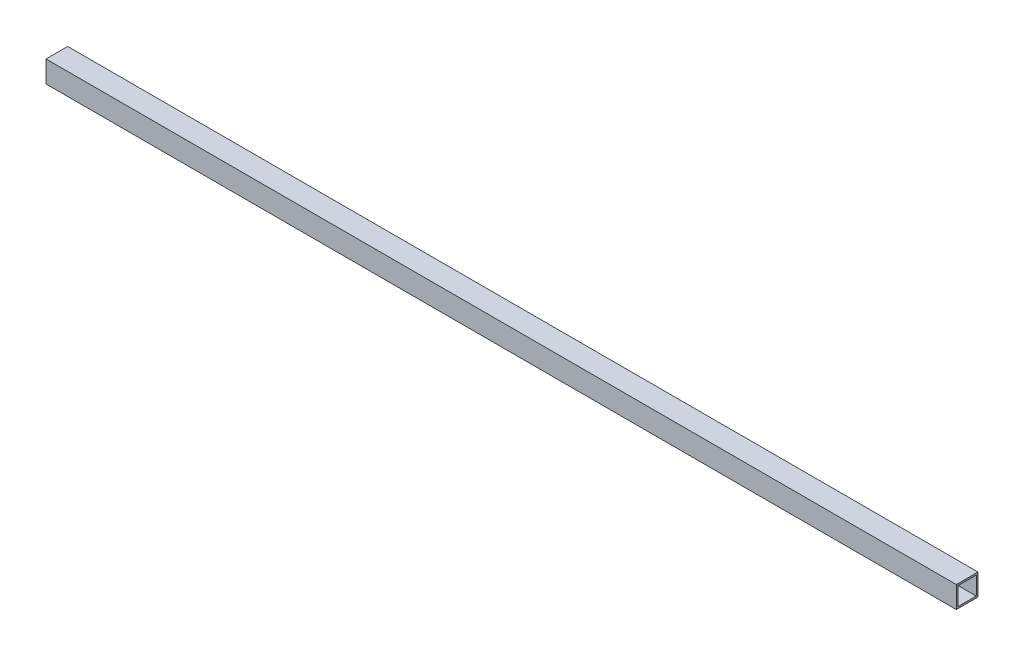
ISO-10303-21;
HEADER;
FILE_DESCRIPTION(('STEP AP214'),'2;1');
FILE_NAME('part.step','',(''),(''),'','','');
FILE_SCHEMA(('AUTOMOTIVE_DESIGN { 1 0 10303 214 1 1 1 1 }'));
ENDSEC;
DATA;
#1=APPLICATION_CONTEXT('core data for automotive mechanical design processes');
#2=APPLICATION_PROTOCOL_DEFINITION('international standard','automotive_design',2000,#1);
#3=PRODUCT_CONTEXT('',#1,'mechanical');
#4=PRODUCT('Part','Part','',(#3));
#5=PRODUCT_RELATED_PRODUCT_CATEGORY('part','',(#4));
#6=PRODUCT_DEFINITION_FORMATION('','',#4);
#7=PRODUCT_DEFINITION_CONTEXT('part definition',#1,'design');
#8=PRODUCT_DEFINITION('design','',#6,#7);
#9=PRODUCT_DEFINITION_SHAPE('','',#8);
#10=(LENGTH_UNIT() NAMED_UNIT(*) SI_UNIT(.MILLI.,.METRE.));
#11=(NAMED_UNIT(*) PLANE_ANGLE_UNIT() SI_UNIT($,.RADIAN.));
#12=(NAMED_UNIT(*) SI_UNIT($,.STERADIAN.) SOLID_ANGLE_UNIT());
#13=UNCERTAINTY_MEASURE_WITH_UNIT(LENGTH_MEASURE(1.E-05),#10,'distance_accuracy_value','');
#14=(GEOMETRIC_REPRESENTATION_CONTEXT(3) GLOBAL_UNCERTAINTY_ASSIGNED_CONTEXT((#13)) GLOBAL_UNIT_ASSIGNED_CONTEXT((#10,
#11,#12)) REPRESENTATION_CONTEXT('',''));
#15=CARTESIAN_POINT('',(0.,0.,0.));
#16=DIRECTION('',(0.,0.,1.));
#17=DIRECTION('',(1.,0.,0.));
#18=AXIS2_PLACEMENT_3D('',#15,#16,#17);
#19=CARTESIAN_POINT('',(1050.,0.,25.));
#20=DIRECTION('',(0.,1.,0.));
#21=DIRECTION('',(-1.,0.,0.));
#22=AXIS2_PLACEMENT_3D('',#19,#20,#21);
#23=PLANE('',#22);
#24=DIRECTION('',(1.,0.,0.));
#25=VECTOR('',#24,1.);
#26=CARTESIAN_POINT('',(1050.,0.,0.));
#27=LINE('',#26,#25);
#28=CARTESIAN_POINT('',(0.,0.,0.));
#29=VERTEX_POINT('',#28);
#30=CARTESIAN_POINT('',(1050.,0.,0.));
#31=VERTEX_POINT('',#30);
#32=EDGE_CURVE('E142',#29,#31,#27,.T.);
#33=ORIENTED_EDGE('',*,*,#32,.T.);
#34=DIRECTION('',(0.,0.,-1.));
#35=VECTOR('',#34,1.);
#36=CARTESIAN_POINT('',(1050.,0.,25.));
#37=LINE('',#36,#35);
#38=CARTESIAN_POINT('',(1050.,0.,25.));
#39=VERTEX_POINT('',#38);
#40=EDGE_CURVE('E12',#39,#31,#37,.T.);
#41=ORIENTED_EDGE('',*,*,#40,.F.);
#42=DIRECTION('',(1.,0.,0.));
#43=VECTOR('',#42,1.);
#44=CARTESIAN_POINT('',(1050.,0.,25.));
#45=LINE('',#44,#43);
#46=CARTESIAN_POINT('',(0.,0.,25.));
#47=VERTEX_POINT('',#46);
#48=EDGE_CURVE('E146',#47,#39,#45,.T.);
#49=ORIENTED_EDGE('',*,*,#48,.F.);
#50=DIRECTION('',(0.,0.,-1.));
#51=VECTOR('',#50,1.);
#52=CARTESIAN_POINT('',(0.,0.,25.));
#53=LINE('',#52,#51);
#54=EDGE_CURVE('E156',#47,#29,#53,.T.);
#55=ORIENTED_EDGE('',*,*,#54,.T.);
#56=EDGE_LOOP('',(#33,#41,#49,#55));
#57=FACE_BOUND('',#56,.T.);
#58=ADVANCED_FACE('F45',(#57),#23,.F.);
#59=CARTESIAN_POINT('',(1050.,25.,25.));
#60=DIRECTION('',(-1.,0.,0.));
#61=DIRECTION('',(0.,0.,1.));
#62=AXIS2_PLACEMENT_3D('',#59,#60,#61);
#63=PLANE('',#62);
#64=DIRECTION('',(0.,0.,-1.));
#65=VECTOR('',#64,1.);
#66=CARTESIAN_POINT('',(1050.,23.0000000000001,2.));
#67=LINE('',#66,#65);
#68=CARTESIAN_POINT('',(1050.,23.0000000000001,23.));
#69=VERTEX_POINT('',#68);
#70=CARTESIAN_POINT('',(1050.,23.0000000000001,2.));
#71=VERTEX_POINT('',#70);
#72=EDGE_CURVE('E117',#69,#71,#67,.T.);
#73=ORIENTED_EDGE('',*,*,#72,.T.);
#74=DIRECTION('',(0.,-1.,0.));
#75=VECTOR('',#74,1.);
#76=CARTESIAN_POINT('',(1050.,2.00000000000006,2.));
#77=LINE('',#76,#75);
#78=CARTESIAN_POINT('',(1050.,2.00000000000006,2.));
#79=VERTEX_POINT('',#78);
#80=EDGE_CURVE('E111',#71,#79,#77,.T.);
#81=ORIENTED_EDGE('',*,*,#80,.T.);
#82=DIRECTION('',(0.,0.,1.));
#83=VECTOR('',#82,1.);
#84=CARTESIAN_POINT('',(1050.,2.00000000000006,2.));
#85=LINE('',#84,#83);
#86=CARTESIAN_POINT('',(1050.,2.00000000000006,23.));
#87=VERTEX_POINT('',#86);
#88=EDGE_CURVE('E120',#79,#87,#85,.T.);
#89=ORIENTED_EDGE('',*,*,#88,.T.);
#90=DIRECTION('',(0.,1.,0.));
#91=VECTOR('',#90,1.);
#92=CARTESIAN_POINT('',(1050.,2.00000000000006,23.));
#93=LINE('',#92,#91);
#94=EDGE_CURVE('E59',#87,#69,#93,.T.);
#95=ORIENTED_EDGE('',*,*,#94,.T.);
#96=EDGE_LOOP('',(#73,#81,#89,#95));
#97=FACE_BOUND('',#96,.T.);
#98=DIRECTION('',(0.,1.,0.));
#99=VECTOR('',#98,1.);
#100=CARTESIAN_POINT('',(1050.,25.,0.));
#101=LINE('',#100,#99);
#102=CARTESIAN_POINT('',(1050.,25.,0.));
#103=VERTEX_POINT('',#102);
#104=EDGE_CURVE('E159',#31,#103,#101,.T.);
#105=ORIENTED_EDGE('',*,*,#104,.T.);
#106=DIRECTION('',(0.,0.,-1.));
#107=VECTOR('',#106,1.);
#108=CARTESIAN_POINT('',(1050.,25.,25.));
#109=LINE('',#108,#107);
#110=CARTESIAN_POINT('',(1050.,25.,25.));
#111=VERTEX_POINT('',#110);
#112=EDGE_CURVE('E52',#111,#103,#109,.T.);
#113=ORIENTED_EDGE('',*,*,#112,.F.);
#114=DIRECTION('',(0.,1.,0.));
#115=VECTOR('',#114,1.);
#116=CARTESIAN_POINT('',(1050.,25.,25.));
#117=LINE('',#116,#115);
#118=EDGE_CURVE('E149',#39,#111,#117,.T.);
#119=ORIENTED_EDGE('',*,*,#118,.F.);
#120=ORIENTED_EDGE('',*,*,#40,.T.);
#121=EDGE_LOOP('',(#105,#113,#119,#120));
#122=FACE_BOUND('',#121,.T.);
#123=ADVANCED_FACE('F124',(#97,#122),#63,.F.);
#124=CARTESIAN_POINT('',(0.,25.,25.));
#125=DIRECTION('',(0.,-1.,0.));
#126=DIRECTION('',(1.,0.,0.));
#127=AXIS2_PLACEMENT_3D('',#124,#125,#126);
#128=PLANE('',#127);
#129=DIRECTION('',(-1.,0.,0.));
#130=VECTOR('',#129,1.);
#131=CARTESIAN_POINT('',(0.,25.,0.));
#132=LINE('',#131,#130);
#133=CARTESIAN_POINT('',(0.,25.,0.));
#134=VERTEX_POINT('',#133);
#135=EDGE_CURVE('E161',#103,#134,#132,.T.);
#136=ORIENTED_EDGE('',*,*,#135,.T.);
#137=DIRECTION('',(0.,0.,-1.));
#138=VECTOR('',#137,1.);
#139=CARTESIAN_POINT('',(0.,25.,25.));
#140=LINE('',#139,#138);
#141=CARTESIAN_POINT('',(0.,25.,25.));
#142=VERTEX_POINT('',#141);
#143=EDGE_CURVE('E167',#142,#134,#140,.T.);
#144=ORIENTED_EDGE('',*,*,#143,.F.);
#145=DIRECTION('',(-1.,0.,0.));
#146=VECTOR('',#145,1.);
#147=CARTESIAN_POINT('',(0.,25.,25.));
#148=LINE('',#147,#146);
#149=EDGE_CURVE('E152',#111,#142,#148,.T.);
#150=ORIENTED_EDGE('',*,*,#149,.F.);
#151=ORIENTED_EDGE('',*,*,#112,.T.);
#152=EDGE_LOOP('',(#136,#144,#150,#151));
#153=FACE_BOUND('',#152,.T.);
#154=ADVANCED_FACE('F174',(#153),#128,.F.);
#155=CARTESIAN_POINT('',(0.,0.,25.));
#156=DIRECTION('',(1.,0.,0.));
#157=DIRECTION('',(0.,0.,-1.));
#158=AXIS2_PLACEMENT_3D('',#155,#156,#157);
#159=PLANE('',#158);
#160=DIRECTION('',(0.,0.,1.));
#161=VECTOR('',#160,1.);
#162=CARTESIAN_POINT('',(0.,2.,2.));
#163=LINE('',#162,#161);
#164=CARTESIAN_POINT('',(0.,2.,2.));
#165=VERTEX_POINT('',#164);
#166=CARTESIAN_POINT('',(0.,2.,23.));
#167=VERTEX_POINT('',#166);
#168=EDGE_CURVE('E136',#165,#167,#163,.T.);
#169=ORIENTED_EDGE('',*,*,#168,.F.);
#170=DIRECTION('',(0.,-1.,0.));
#171=VECTOR('',#170,1.);
#172=CARTESIAN_POINT('',(0.,2.,2.));
#173=LINE('',#172,#171);
#174=CARTESIAN_POINT('',(0.,23.,2.));
#175=VERTEX_POINT('',#174);
#176=EDGE_CURVE('E67',#175,#165,#173,.T.);
#177=ORIENTED_EDGE('',*,*,#176,.F.);
#178=DIRECTION('',(0.,0.,-1.));
#179=VECTOR('',#178,1.);
#180=CARTESIAN_POINT('',(0.,23.,2.));
#181=LINE('',#180,#179);
#182=CARTESIAN_POINT('',(0.,23.,23.));
#183=VERTEX_POINT('',#182);
#184=EDGE_CURVE('E127',#183,#175,#181,.T.);
#185=ORIENTED_EDGE('',*,*,#184,.F.);
#186=DIRECTION('',(0.,1.,0.));
#187=VECTOR('',#186,1.);
#188=CARTESIAN_POINT('',(0.,2.,23.));
#189=LINE('',#188,#187);
#190=EDGE_CURVE('E130',#167,#183,#189,.T.);
#191=ORIENTED_EDGE('',*,*,#190,.F.);
#192=EDGE_LOOP('',(#169,#177,#185,#191));
#193=FACE_BOUND('',#192,.T.);
#194=DIRECTION('',(0.,-1.,0.));
#195=VECTOR('',#194,1.);
#196=CARTESIAN_POINT('',(0.,0.,0.));
#197=LINE('',#196,#195);
#198=EDGE_CURVE('E150',#134,#29,#197,.T.);
#199=ORIENTED_EDGE('',*,*,#198,.T.);
#200=ORIENTED_EDGE('',*,*,#54,.F.);
#201=DIRECTION('',(0.,-1.,0.));
#202=VECTOR('',#201,1.);
#203=CARTESIAN_POINT('',(0.,0.,25.));
#204=LINE('',#203,#202);
#205=EDGE_CURVE('E154',#142,#47,#204,.T.);
#206=ORIENTED_EDGE('',*,*,#205,.F.);
#207=ORIENTED_EDGE('',*,*,#143,.T.);
#208=EDGE_LOOP('',(#199,#200,#206,#207));
#209=FACE_BOUND('',#208,.T.);
#210=ADVANCED_FACE('F182',(#193,#209),#159,.F.);
#211=CARTESIAN_POINT('',(0.,0.,25.));
#212=DIRECTION('',(0.,0.,-1.));
#213=DIRECTION('',(-1.,0.,0.));
#214=AXIS2_PLACEMENT_3D('',#211,#212,#213);
#215=PLANE('',#214);
#216=ORIENTED_EDGE('',*,*,#48,.T.);
#217=ORIENTED_EDGE('',*,*,#118,.T.);
#218=ORIENTED_EDGE('',*,*,#149,.T.);
#219=ORIENTED_EDGE('',*,*,#205,.T.);
#220=EDGE_LOOP('',(#216,#217,#218,#219));
#221=FACE_BOUND('',#220,.T.);
#222=ADVANCED_FACE('F188',(#221),#215,.F.);
#223=CARTESIAN_POINT('',(0.,0.,0.));
#224=DIRECTION('',(0.,0.,-1.));
#225=DIRECTION('',(-1.,0.,0.));
#226=AXIS2_PLACEMENT_3D('',#223,#224,#225);
#227=PLANE('',#226);
#228=ORIENTED_EDGE('',*,*,#32,.F.);
#229=ORIENTED_EDGE('',*,*,#198,.F.);
#230=ORIENTED_EDGE('',*,*,#135,.F.);
#231=ORIENTED_EDGE('',*,*,#104,.F.);
#232=EDGE_LOOP('',(#228,#229,#230,#231));
#233=FACE_BOUND('',#232,.T.);
#234=ADVANCED_FACE('F179',(#233),#227,.T.);
#235=CARTESIAN_POINT('',(1050.,2.00000000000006,2.));
#236=DIRECTION('',(0.,0.,-1.));
#237=DIRECTION('',(-1.,0.,0.));
#238=AXIS2_PLACEMENT_3D('',#235,#236,#237);
#239=PLANE('',#238);
#240=ORIENTED_EDGE('',*,*,#176,.T.);
#241=DIRECTION('',(-1.,0.,0.));
#242=VECTOR('',#241,1.);
#243=CARTESIAN_POINT('',(1050.,2.00000000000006,2.));
#244=LINE('',#243,#242);
#245=EDGE_CURVE('E107',#79,#165,#244,.T.);
#246=ORIENTED_EDGE('',*,*,#245,.F.);
#247=ORIENTED_EDGE('',*,*,#80,.F.);
#248=DIRECTION('',(-1.,0.,0.));
#249=VECTOR('',#248,1.);
#250=CARTESIAN_POINT('',(1050.,23.0000000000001,2.));
#251=LINE('',#250,#249);
#252=EDGE_CURVE('E140',#71,#175,#251,.T.);
#253=ORIENTED_EDGE('',*,*,#252,.T.);
#254=EDGE_LOOP('',(#240,#246,#247,#253));
#255=FACE_BOUND('',#254,.T.);
#256=ADVANCED_FACE('F109',(#255),#239,.F.);
#257=CARTESIAN_POINT('',(1050.,23.0000000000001,2.));
#258=DIRECTION('',(0.,1.,0.));
#259=DIRECTION('',(-1.,0.,0.));
#260=AXIS2_PLACEMENT_3D('',#257,#258,#259);
#261=PLANE('',#260);
#262=ORIENTED_EDGE('',*,*,#184,.T.);
#263=ORIENTED_EDGE('',*,*,#252,.F.);
#264=ORIENTED_EDGE('',*,*,#72,.F.);
#265=DIRECTION('',(-1.,0.,0.));
#266=VECTOR('',#265,1.);
#267=CARTESIAN_POINT('',(1050.,23.0000000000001,23.));
#268=LINE('',#267,#266);
#269=EDGE_CURVE('E143',#69,#183,#268,.T.);
#270=ORIENTED_EDGE('',*,*,#269,.T.);
#271=EDGE_LOOP('',(#262,#263,#264,#270));
#272=FACE_BOUND('',#271,.T.);
#273=ADVANCED_FACE('F205',(#272),#261,.F.);
#274=CARTESIAN_POINT('',(1050.,2.00000000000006,23.));
#275=DIRECTION('',(0.,0.,1.));
#276=DIRECTION('',(1.,0.,0.));
#277=AXIS2_PLACEMENT_3D('',#274,#275,#276);
#278=PLANE('',#277);
#279=ORIENTED_EDGE('',*,*,#190,.T.);
#280=ORIENTED_EDGE('',*,*,#269,.F.);
#281=ORIENTED_EDGE('',*,*,#94,.F.);
#282=DIRECTION('',(-1.,0.,0.));
#283=VECTOR('',#282,1.);
#284=CARTESIAN_POINT('',(1050.,2.00000000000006,23.));
#285=LINE('',#284,#283);
#286=EDGE_CURVE('E116',#87,#167,#285,.T.);
#287=ORIENTED_EDGE('',*,*,#286,.T.);
#288=EDGE_LOOP('',(#279,#280,#281,#287));
#289=FACE_BOUND('',#288,.T.);
#290=ADVANCED_FACE('F208',(#289),#278,.F.);
#291=CARTESIAN_POINT('',(1050.,2.00000000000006,2.));
#292=DIRECTION('',(0.,-1.,0.));
#293=DIRECTION('',(1.,0.,0.));
#294=AXIS2_PLACEMENT_3D('',#291,#292,#293);
#295=PLANE('',#294);
#296=ORIENTED_EDGE('',*,*,#168,.T.);
#297=ORIENTED_EDGE('',*,*,#286,.F.);
#298=ORIENTED_EDGE('',*,*,#88,.F.);
#299=ORIENTED_EDGE('',*,*,#245,.T.);
#300=EDGE_LOOP('',(#296,#297,#298,#299));
#301=FACE_BOUND('',#300,.T.);
#302=ADVANCED_FACE('F121',(#301),#295,.F.);
#303=CLOSED_SHELL('',(#58,#123,#154,#210,#222,#234,#256,#273,#290,#302));
#304=MANIFOLD_SOLID_BREP('B2',#303);
#305=ADVANCED_BREP_SHAPE_REPRESENTATION('',(#18,#304),#14);
#306=SHAPE_DEFINITION_REPRESENTATION(#9,#305);
ENDSEC;
END-ISO-10303-21;
